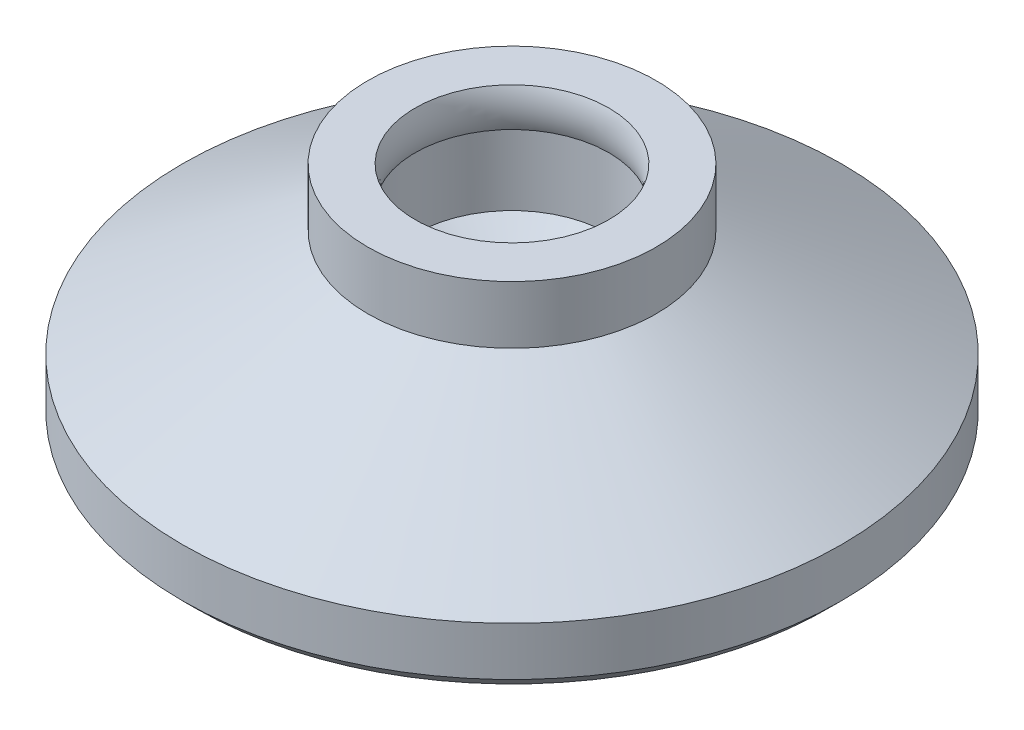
ISO-10303-21;
HEADER;
FILE_DESCRIPTION(('STEP AP214'),'2;1');
FILE_NAME('part.step','',(''),(''),'','','');
FILE_SCHEMA(('AUTOMOTIVE_DESIGN { 1 0 10303 214 1 1 1 1 }'));
ENDSEC;
DATA;
#1=APPLICATION_CONTEXT('core data for automotive mechanical design processes');
#2=APPLICATION_PROTOCOL_DEFINITION('international standard','automotive_design',2000,#1);
#3=PRODUCT_CONTEXT('',#1,'mechanical');
#4=PRODUCT('Part','Part','',(#3));
#5=PRODUCT_RELATED_PRODUCT_CATEGORY('part','',(#4));
#6=PRODUCT_DEFINITION_FORMATION('','',#4);
#7=PRODUCT_DEFINITION_CONTEXT('part definition',#1,'design');
#8=PRODUCT_DEFINITION('design','',#6,#7);
#9=PRODUCT_DEFINITION_SHAPE('','',#8);
#10=(LENGTH_UNIT() NAMED_UNIT(*) SI_UNIT(.MILLI.,.METRE.));
#11=(NAMED_UNIT(*) PLANE_ANGLE_UNIT() SI_UNIT($,.RADIAN.));
#12=(NAMED_UNIT(*) SI_UNIT($,.STERADIAN.) SOLID_ANGLE_UNIT());
#13=UNCERTAINTY_MEASURE_WITH_UNIT(LENGTH_MEASURE(1.E-05),#10,'distance_accuracy_value','');
#14=(GEOMETRIC_REPRESENTATION_CONTEXT(3) GLOBAL_UNCERTAINTY_ASSIGNED_CONTEXT((#13)) GLOBAL_UNIT_ASSIGNED_CONTEXT((#10,
#11,#12)) REPRESENTATION_CONTEXT('',''));
#15=CARTESIAN_POINT('',(0.,0.,0.));
#16=DIRECTION('',(0.,0.,1.));
#17=DIRECTION('',(1.,0.,0.));
#18=AXIS2_PLACEMENT_3D('',#15,#16,#17);
#19=CARTESIAN_POINT('',(0.,5.5,0.));
#20=DIRECTION('',(0.,-1.,0.));
#21=DIRECTION('',(0.,0.,-1.));
#22=AXIS2_PLACEMENT_3D('',#19,#20,#21);
#23=CYLINDRICAL_SURFACE('',#22,7.);
#24=CARTESIAN_POINT('',(0.,2.69615242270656,0.));
#25=DIRECTION('',(0.,1.,0.));
#26=DIRECTION('',(0.,0.,1.));
#27=AXIS2_PLACEMENT_3D('',#24,#25,#26);
#28=CIRCLE('',#27,7.);
#29=CARTESIAN_POINT('',(0.,2.69615242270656,7.));
#30=VERTEX_POINT('',#29);
#31=EDGE_CURVE('E91',#30,#30,#28,.T.);
#32=ORIENTED_EDGE('',*,*,#31,.T.);
#33=EDGE_LOOP('',(#32));
#34=FACE_BOUND('',#33,.T.);
#35=CARTESIAN_POINT('',(0.,5.5,0.));
#36=DIRECTION('',(0.,1.,0.));
#37=DIRECTION('',(0.,0.,1.));
#38=AXIS2_PLACEMENT_3D('',#35,#36,#37);
#39=CIRCLE('',#38,7.);
#40=CARTESIAN_POINT('',(0.,5.5,7.));
#41=VERTEX_POINT('',#40);
#42=EDGE_CURVE('E93',#41,#41,#39,.T.);
#43=ORIENTED_EDGE('',*,*,#42,.F.);
#44=EDGE_LOOP('',(#43));
#45=FACE_BOUND('',#44,.T.);
#46=ADVANCED_FACE('F37',(#34,#45),#23,.T.);
#47=CARTESIAN_POINT('',(0.,5.5,0.));
#48=DIRECTION('',(0.,1.,0.));
#49=DIRECTION('',(0.,0.,1.));
#50=AXIS2_PLACEMENT_3D('',#47,#48,#49);
#51=PLANE('',#50);
#52=CARTESIAN_POINT('',(0.,5.5,0.));
#53=DIRECTION('',(0.,-1.,0.));
#54=DIRECTION('',(0.,0.,-1.));
#55=AXIS2_PLACEMENT_3D('',#52,#53,#54);
#56=CIRCLE('',#55,4.7);
#57=CARTESIAN_POINT('',(0.,5.5,-4.7));
#58=VERTEX_POINT('',#57);
#59=EDGE_CURVE('E108',#58,#58,#56,.T.);
#60=ORIENTED_EDGE('',*,*,#59,.T.);
#61=EDGE_LOOP('',(#60));
#62=FACE_BOUND('',#61,.T.);
#63=ORIENTED_EDGE('',*,*,#42,.T.);
#64=EDGE_LOOP('',(#63));
#65=FACE_BOUND('',#64,.T.);
#66=ADVANCED_FACE('F65',(#62,#65),#51,.T.);
#67=CARTESIAN_POINT('',(0.,2.69615242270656,0.));
#68=DIRECTION('',(0.,-1.,0.));
#69=DIRECTION('',(0.,0.,-1.));
#70=AXIS2_PLACEMENT_3D('',#67,#68,#69);
#71=CONICAL_SURFACE('',#70,7.,1.0471975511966);
#72=CARTESIAN_POINT('',(0.,-2.5,0.));
#73=DIRECTION('',(0.,1.,0.));
#74=DIRECTION('',(0.,0.,1.));
#75=AXIS2_PLACEMENT_3D('',#72,#73,#74);
#76=CIRCLE('',#75,16.);
#77=CARTESIAN_POINT('',(0.,-2.5,16.));
#78=VERTEX_POINT('',#77);
#79=EDGE_CURVE('E89',#78,#78,#76,.T.);
#80=ORIENTED_EDGE('',*,*,#79,.T.);
#81=EDGE_LOOP('',(#80));
#82=FACE_BOUND('',#81,.T.);
#83=ORIENTED_EDGE('',*,*,#31,.F.);
#84=EDGE_LOOP('',(#83));
#85=FACE_BOUND('',#84,.T.);
#86=ADVANCED_FACE('F70',(#82,#85),#71,.T.);
#87=CARTESIAN_POINT('',(0.,-5.5,0.));
#88=DIRECTION('',(0.,1.,0.));
#89=DIRECTION('',(0.,0.,1.));
#90=AXIS2_PLACEMENT_3D('',#87,#88,#89);
#91=PLANE('',#90);
#92=CARTESIAN_POINT('',(0.,-5.5,0.));
#93=DIRECTION('',(0.,1.,0.));
#94=DIRECTION('',(0.,0.,1.));
#95=AXIS2_PLACEMENT_3D('',#92,#93,#94);
#96=CIRCLE('',#95,15.36);
#97=CARTESIAN_POINT('',(0.,-5.5,15.36));
#98=VERTEX_POINT('',#97);
#99=EDGE_CURVE('E45',#98,#98,#96,.F.);
#100=ORIENTED_EDGE('',*,*,#99,.T.);
#101=EDGE_LOOP('',(#100));
#102=FACE_BOUND('',#101,.T.);
#103=ADVANCED_FACE('F76',(#102),#91,.F.);
#104=CARTESIAN_POINT('',(0.,-2.5,0.));
#105=DIRECTION('',(0.,-1.,0.));
#106=DIRECTION('',(0.,0.,-1.));
#107=AXIS2_PLACEMENT_3D('',#104,#105,#106);
#108=CYLINDRICAL_SURFACE('',#107,16.);
#109=CARTESIAN_POINT('',(0.,-4.85999999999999,0.));
#110=DIRECTION('',(0.,1.,0.));
#111=DIRECTION('',(0.,0.,1.));
#112=AXIS2_PLACEMENT_3D('',#109,#110,#111);
#113=CIRCLE('',#112,16.);
#114=CARTESIAN_POINT('',(0.,-4.85999999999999,16.));
#115=VERTEX_POINT('',#114);
#116=EDGE_CURVE('E11',#115,#115,#113,.T.);
#117=ORIENTED_EDGE('',*,*,#116,.T.);
#118=EDGE_LOOP('',(#117));
#119=FACE_BOUND('',#118,.T.);
#120=ORIENTED_EDGE('',*,*,#79,.F.);
#121=EDGE_LOOP('',(#120));
#122=FACE_BOUND('',#121,.T.);
#123=ADVANCED_FACE('F60',(#119,#122),#108,.T.);
#124=CARTESIAN_POINT('',(0.,-5.5,0.));
#125=DIRECTION('',(0.,1.,0.));
#126=DIRECTION('',(0.,0.,1.));
#127=AXIS2_PLACEMENT_3D('',#124,#125,#126);
#128=CONICAL_SURFACE('',#127,15.36,0.785398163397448);
#129=CARTESIAN_POINT('',(0.,-4.85999999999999,16.));
#130=CARTESIAN_POINT('',(0.,-4.86666666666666,15.9933333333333));
#131=CARTESIAN_POINT('',(0.,-4.87333333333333,15.9866666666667));
#132=CARTESIAN_POINT('',(0.,-4.88666666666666,15.9733333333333));
#133=CARTESIAN_POINT('',(0.,-4.89333333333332,15.9666666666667));
#134=CARTESIAN_POINT('',(0.,-4.90666666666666,15.9533333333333));
#135=CARTESIAN_POINT('',(0.,-4.91333333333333,15.9466666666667));
#136=CARTESIAN_POINT('',(0.,-4.92666666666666,15.9333333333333));
#137=CARTESIAN_POINT('',(0.,-4.93333333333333,15.9266666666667));
#138=CARTESIAN_POINT('',(0.,-4.94666666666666,15.9133333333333));
#139=CARTESIAN_POINT('',(0.,-4.95333333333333,15.9066666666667));
#140=CARTESIAN_POINT('',(0.,-4.96666666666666,15.8933333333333));
#141=CARTESIAN_POINT('',(0.,-4.97333333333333,15.8866666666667));
#142=CARTESIAN_POINT('',(0.,-4.98666666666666,15.8733333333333));
#143=CARTESIAN_POINT('',(0.,-4.99333333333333,15.8666666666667));
#144=CARTESIAN_POINT('',(0.,-5.00666666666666,15.8533333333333));
#145=CARTESIAN_POINT('',(0.,-5.01333333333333,15.8466666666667));
#146=CARTESIAN_POINT('',(0.,-5.02666666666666,15.8333333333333));
#147=CARTESIAN_POINT('',(0.,-5.03333333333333,15.8266666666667));
#148=CARTESIAN_POINT('',(0.,-5.04666666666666,15.8133333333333));
#149=CARTESIAN_POINT('',(0.,-5.05333333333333,15.8066666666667));
#150=CARTESIAN_POINT('',(0.,-5.06666666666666,15.7933333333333));
#151=CARTESIAN_POINT('',(0.,-5.07333333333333,15.7866666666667));
#152=CARTESIAN_POINT('',(0.,-5.08666666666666,15.7733333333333));
#153=CARTESIAN_POINT('',(0.,-5.09333333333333,15.7666666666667));
#154=CARTESIAN_POINT('',(0.,-5.10666666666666,15.7533333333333));
#155=CARTESIAN_POINT('',(0.,-5.11333333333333,15.7466666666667));
#156=CARTESIAN_POINT('',(0.,-5.12666666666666,15.7333333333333));
#157=CARTESIAN_POINT('',(0.,-5.13333333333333,15.7266666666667));
#158=CARTESIAN_POINT('',(0.,-5.14666666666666,15.7133333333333));
#159=CARTESIAN_POINT('',(0.,-5.15333333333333,15.7066666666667));
#160=CARTESIAN_POINT('',(0.,-5.16666666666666,15.6933333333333));
#161=CARTESIAN_POINT('',(0.,-5.17333333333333,15.6866666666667));
#162=CARTESIAN_POINT('',(0.,-5.18666666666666,15.6733333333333));
#163=CARTESIAN_POINT('',(0.,-5.19333333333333,15.6666666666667));
#164=CARTESIAN_POINT('',(0.,-5.20666666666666,15.6533333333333));
#165=CARTESIAN_POINT('',(0.,-5.21333333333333,15.6466666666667));
#166=CARTESIAN_POINT('',(0.,-5.22666666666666,15.6333333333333));
#167=CARTESIAN_POINT('',(0.,-5.23333333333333,15.6266666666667));
#168=CARTESIAN_POINT('',(0.,-5.24666666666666,15.6133333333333));
#169=CARTESIAN_POINT('',(0.,-5.25333333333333,15.6066666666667));
#170=CARTESIAN_POINT('',(0.,-5.26666666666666,15.5933333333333));
#171=CARTESIAN_POINT('',(0.,-5.27333333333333,15.5866666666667));
#172=CARTESIAN_POINT('',(0.,-5.28666666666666,15.5733333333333));
#173=CARTESIAN_POINT('',(0.,-5.29333333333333,15.5666666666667));
#174=CARTESIAN_POINT('',(0.,-5.30666666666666,15.5533333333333));
#175=CARTESIAN_POINT('',(0.,-5.31333333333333,15.5466666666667));
#176=CARTESIAN_POINT('',(0.,-5.32666666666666,15.5333333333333));
#177=CARTESIAN_POINT('',(0.,-5.33333333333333,15.5266666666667));
#178=CARTESIAN_POINT('',(0.,-5.34666666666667,15.5133333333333));
#179=CARTESIAN_POINT('',(0.,-5.35333333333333,15.5066666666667));
#180=CARTESIAN_POINT('',(0.,-5.36666666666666,15.4933333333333));
#181=CARTESIAN_POINT('',(0.,-5.37333333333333,15.4866666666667));
#182=CARTESIAN_POINT('',(0.,-5.38666666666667,15.4733333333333));
#183=CARTESIAN_POINT('',(0.,-5.39333333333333,15.4666666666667));
#184=CARTESIAN_POINT('',(0.,-5.40666666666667,15.4533333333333));
#185=CARTESIAN_POINT('',(0.,-5.41333333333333,15.4466666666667));
#186=CARTESIAN_POINT('',(0.,-5.42666666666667,15.4333333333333));
#187=CARTESIAN_POINT('',(0.,-5.43333333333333,15.4266666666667));
#188=CARTESIAN_POINT('',(0.,-5.44666666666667,15.4133333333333));
#189=CARTESIAN_POINT('',(0.,-5.45333333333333,15.4066666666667));
#190=CARTESIAN_POINT('',(0.,-5.46666666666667,15.3933333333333));
#191=CARTESIAN_POINT('',(0.,-5.47333333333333,15.3866666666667));
#192=CARTESIAN_POINT('',(0.,-5.48666666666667,15.3733333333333));
#193=CARTESIAN_POINT('',(0.,-5.49333333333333,15.3666666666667));
#194=CARTESIAN_POINT('',(0.,-5.5,15.36));
#195=B_SPLINE_CURVE_WITH_KNOTS('',3,(#129,#130,#131,#132,#133,#134,#135,#136,#137,#138,#139,
#140,#141,#142,#143,#144,#145,#146,#147,#148,#149,#150,#151,#152,#153,#154,#155,#156,#157,#158,
#159,#160,#161,#162,#163,#164,#165,#166,#167,#168,#169,#170,#171,#172,#173,#174,#175,#176,#177,
#178,#179,#180,#181,#182,#183,#184,#185,#186,#187,#188,#189,#190,#191,#192,#193,#194),
.UNSPECIFIED.,.F.,.F.,(4,2,2,2,2,2,2,2,2,2,2,2,2,2,2,2,2,2,2,2,2,2,2,2,2,2,2,2,2,2,2,2,4),(0.,
0.0282842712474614,0.0565685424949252,0.0848528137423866,0.113137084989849,0.141421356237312,
0.169705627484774,0.197989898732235,0.2262741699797,0.254558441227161,0.282842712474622,
0.311126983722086,0.339411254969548,0.367695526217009,0.395979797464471,0.424264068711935,
0.452548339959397,0.480832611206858,0.509116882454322,0.537401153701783,0.565685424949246,
0.593969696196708,0.62225396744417,0.650538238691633,0.678822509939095,0.707106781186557,
0.735391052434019,0.763675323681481,0.791959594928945,0.820243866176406,0.848528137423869,
0.876812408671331,0.905096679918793),.UNSPECIFIED.);
#196=EDGE_CURVE('BSEAM39',#115,#98,#195,.T.);
#197=ORIENTED_EDGE('',*,*,#116,.F.);
#198=ORIENTED_EDGE('',*,*,#99,.F.);
#199=ORIENTED_EDGE('',*,*,#196,.T.);
#200=ORIENTED_EDGE('',*,*,#196,.F.);
#201=EDGE_LOOP('',(#197,#199,#198,#200));
#202=FACE_BOUND('',#201,.T.);
#203=ADVANCED_FACE('F39',(#202),#128,.T.);
#204=CARTESIAN_POINT('',(0.,-2.5,0.));
#205=DIRECTION('',(0.,1.,0.));
#206=DIRECTION('',(0.,0.,1.));
#207=AXIS2_PLACEMENT_3D('',#204,#205,#206);
#208=CONICAL_SURFACE('',#207,0.,1.04719755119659);
#209=CARTESIAN_POINT('',(0.,0.213546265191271,0.));
#210=DIRECTION('',(0.,-1.,0.));
#211=DIRECTION('',(0.,0.,-1.));
#212=AXIS2_PLACEMENT_3D('',#209,#210,#211);
#213=CIRCLE('',#212,4.7);
#214=CARTESIAN_POINT('',(0.,0.213546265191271,-4.7));
#215=VERTEX_POINT('',#214);
#216=EDGE_CURVE('E101',#215,#215,#213,.T.);
#217=ORIENTED_EDGE('',*,*,#216,.F.);
#218=EDGE_LOOP('',(#217));
#219=FACE_BOUND('',#218,.T.);
#220=CARTESIAN_POINT('',(0.,-2.5,0.));
#221=VERTEX_POINT('',#220);
#222=VERTEX_LOOP('',#221);
#223=FACE_BOUND('',#222,.T.);
#224=ADVANCED_FACE('F48',(#219,#223),#208,.F.);
#225=CARTESIAN_POINT('',(0.,0.,0.));
#226=DIRECTION('',(0.,-1.,0.));
#227=DIRECTION('',(0.,0.,-1.));
#228=AXIS2_PLACEMENT_3D('',#225,#226,#227);
#229=CYLINDRICAL_SURFACE('',#228,4.7);
#230=CARTESIAN_POINT('',(0.,3.62,0.));
#231=DIRECTION('',(0.,-1.,0.));
#232=DIRECTION('',(0.,0.,-1.));
#233=AXIS2_PLACEMENT_3D('',#230,#231,#232);
#234=CIRCLE('',#233,4.7);
#235=CARTESIAN_POINT('',(0.,3.62,-4.7));
#236=VERTEX_POINT('',#235);
#237=EDGE_CURVE('E110',#236,#236,#234,.T.);
#238=ORIENTED_EDGE('',*,*,#237,.F.);
#239=EDGE_LOOP('',(#238));
#240=FACE_BOUND('',#239,.T.);
#241=ORIENTED_EDGE('',*,*,#216,.T.);
#242=EDGE_LOOP('',(#241));
#243=FACE_BOUND('',#242,.T.);
#244=ADVANCED_FACE('F50',(#240,#243),#229,.F.);
#245=CARTESIAN_POINT('',(0.,4.56,0.));
#246=DIRECTION('',(0.,-1.,0.));
#247=DIRECTION('',(0.,0.,-1.));
#248=AXIS2_PLACEMENT_3D('',#245,#246,#247);
#249=TOROIDAL_SURFACE('',#248,6.956,2.444);
#250=ORIENTED_EDGE('',*,*,#59,.F.);
#251=EDGE_LOOP('',(#250));
#252=FACE_BOUND('',#251,.T.);
#253=ORIENTED_EDGE('',*,*,#237,.T.);
#254=EDGE_LOOP('',(#253));
#255=FACE_BOUND('',#254,.T.);
#256=ADVANCED_FACE('F57',(#252,#255),#249,.T.);
#257=CLOSED_SHELL('',(#46,#66,#86,#103,#123,#203,#224,#244,#256));
#258=MANIFOLD_SOLID_BREP('B2',#257);
#259=ADVANCED_BREP_SHAPE_REPRESENTATION('',(#18,#258),#14);
#260=SHAPE_DEFINITION_REPRESENTATION(#9,#259);
ENDSEC;
END-ISO-10303-21;
